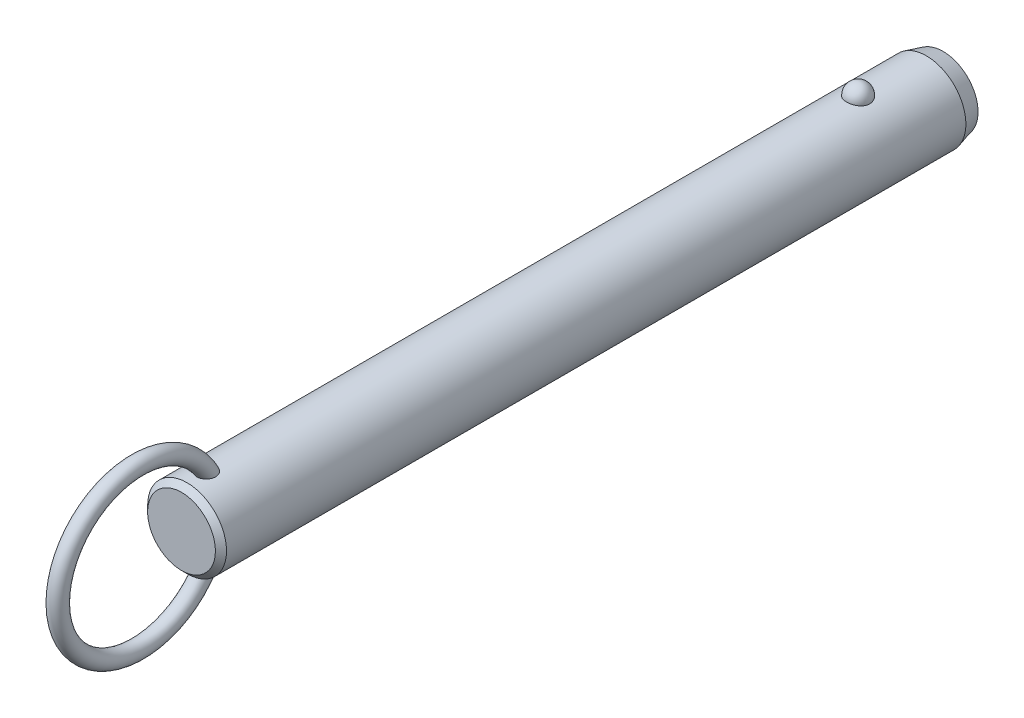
ISO-10303-21;
HEADER;
FILE_DESCRIPTION(('STEP AP214'),'2;1');
FILE_NAME('part.step','',(''),(''),'','','');
FILE_SCHEMA(('AUTOMOTIVE_DESIGN { 1 0 10303 214 1 1 1 1 }'));
ENDSEC;
DATA;
#1=APPLICATION_CONTEXT('core data for automotive mechanical design processes');
#2=APPLICATION_PROTOCOL_DEFINITION('international standard','automotive_design',2000,#1);
#3=PRODUCT_CONTEXT('',#1,'mechanical');
#4=PRODUCT('Part','Part','',(#3));
#5=PRODUCT_RELATED_PRODUCT_CATEGORY('part','',(#4));
#6=PRODUCT_DEFINITION_FORMATION('','',#4);
#7=PRODUCT_DEFINITION_CONTEXT('part definition',#1,'design');
#8=PRODUCT_DEFINITION('design','',#6,#7);
#9=PRODUCT_DEFINITION_SHAPE('','',#8);
#10=(LENGTH_UNIT() NAMED_UNIT(*) SI_UNIT(.MILLI.,.METRE.));
#11=(NAMED_UNIT(*) PLANE_ANGLE_UNIT() SI_UNIT($,.RADIAN.));
#12=(NAMED_UNIT(*) SI_UNIT($,.STERADIAN.) SOLID_ANGLE_UNIT());
#13=UNCERTAINTY_MEASURE_WITH_UNIT(LENGTH_MEASURE(1.E-05),#10,'distance_accuracy_value','');
#14=(GEOMETRIC_REPRESENTATION_CONTEXT(3) GLOBAL_UNCERTAINTY_ASSIGNED_CONTEXT((#13)) GLOBAL_UNIT_ASSIGNED_CONTEXT((#10,
#11,#12)) REPRESENTATION_CONTEXT('',''));
#15=CARTESIAN_POINT('',(0.,0.,0.));
#16=DIRECTION('',(0.,0.,1.));
#17=DIRECTION('',(1.,0.,0.));
#18=AXIS2_PLACEMENT_3D('',#15,#16,#17);
#19=CARTESIAN_POINT('',(0.,0.,111.8));
#20=DIRECTION('',(0.,0.,-1.));
#21=DIRECTION('',(-1.,0.,0.));
#22=AXIS2_PLACEMENT_3D('',#19,#20,#21);
#23=CYLINDRICAL_SURFACE('',#22,7.1);
#24=CARTESIAN_POINT('',(2.0769088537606,6.78943661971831,-2.1));
#25=CARTESIAN_POINT('',(2.07690739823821,6.78943796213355,-1.98268154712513));
#26=CARTESIAN_POINT('',(2.06738130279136,6.79237331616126,-1.86534506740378));
#27=CARTESIAN_POINT('',(2.0295040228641,6.8037853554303,-1.63400788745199));
#28=CARTESIAN_POINT('',(2.00114757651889,6.81226358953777,-1.52000812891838));
#29=CARTESIAN_POINT('',(1.92632025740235,6.83379798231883,-1.29863433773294));
#30=CARTESIAN_POINT('',(1.87985726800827,6.84685214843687,-1.19125744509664));
#31=CARTESIAN_POINT('',(1.76995205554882,6.87608091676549,-0.98604657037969));
#32=CARTESIAN_POINT('',(1.70650980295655,6.8922555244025,-0.88821260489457));
#33=CARTESIAN_POINT('',(1.5638119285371,6.92602930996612,-0.704242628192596));
#34=CARTESIAN_POINT('',(1.4844714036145,6.94363582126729,-0.618173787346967));
#35=CARTESIAN_POINT('',(1.31221746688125,6.97823658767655,-0.460740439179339));
#36=CARTESIAN_POINT('',(1.21930409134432,6.99523084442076,-0.389375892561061));
#37=CARTESIAN_POINT('',(1.02268781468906,7.02666176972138,-0.263547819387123));
#38=CARTESIAN_POINT('',(0.91902009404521,7.04110638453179,-0.209031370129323));
#39=CARTESIAN_POINT('',(0.703548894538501,7.06588726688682,-0.118163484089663));
#40=CARTESIAN_POINT('',(0.591746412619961,7.07622403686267,-0.0818098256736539));
#41=CARTESIAN_POINT('',(0.365557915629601,7.09147068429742,-0.0288711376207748));
#42=CARTESIAN_POINT('',(0.251267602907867,7.09648447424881,-0.0119070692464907));
#43=CARTESIAN_POINT('',(0.0213499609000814,7.10089837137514,0.00304925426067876));
#44=CARTESIAN_POINT('',(-0.0942772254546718,7.10029907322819,0.00104351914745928));
#45=CARTESIAN_POINT('',(-0.321651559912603,7.09360829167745,-0.0216931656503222));
#46=CARTESIAN_POINT('',(-0.433431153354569,7.08760388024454,-0.0421272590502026));
#47=CARTESIAN_POINT('',(-0.651862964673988,7.07086131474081,-0.100729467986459));
#48=CARTESIAN_POINT('',(-0.758515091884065,7.06012307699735,-0.138897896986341));
#49=CARTESIAN_POINT('',(-0.964449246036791,7.03496097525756,-0.232213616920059));
#50=CARTESIAN_POINT('',(-1.06368095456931,7.02051445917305,-0.287465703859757));
#51=CARTESIAN_POINT('',(-1.25145353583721,6.98948740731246,-0.413383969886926));
#52=CARTESIAN_POINT('',(-1.33999321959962,6.97290663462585,-0.48405186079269));
#53=CARTESIAN_POINT('',(-1.50591604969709,6.93898770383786,-0.640594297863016));
#54=CARTESIAN_POINT('',(-1.58302488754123,6.92164094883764,-0.726757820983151));
#55=CARTESIAN_POINT('',(-1.72189320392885,6.8884103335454,-0.91092752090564));
#56=CARTESIAN_POINT('',(-1.78365144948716,6.87252659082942,-1.008934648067));
#57=CARTESIAN_POINT('',(-1.89101272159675,6.84377189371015,-1.21549497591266));
#58=CARTESIAN_POINT('',(-1.93639553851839,6.83094274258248,-1.32416860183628));
#59=CARTESIAN_POINT('',(-2.00874275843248,6.81002070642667,-1.54791500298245));
#60=CARTESIAN_POINT('',(-2.03570774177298,6.80192767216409,-1.66298757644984));
#61=CARTESIAN_POINT('',(-2.07047276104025,6.7914266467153,-1.89571453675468));
#62=CARTESIAN_POINT('',(-2.07835878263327,6.78899315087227,-2.01335491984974));
#63=CARTESIAN_POINT('',(-2.07502083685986,6.79001409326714,-2.24833570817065));
#64=CARTESIAN_POINT('',(-2.06379746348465,6.7934683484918,-2.36567612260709));
#65=CARTESIAN_POINT('',(-2.02263913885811,6.80583442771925,-2.59603194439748));
#66=CARTESIAN_POINT('',(-1.99281127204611,6.81471501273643,-2.70906820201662));
#67=CARTESIAN_POINT('',(-1.91526639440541,6.83691232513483,-2.92836575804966));
#68=CARTESIAN_POINT('',(-1.8675486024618,6.85022924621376,-3.03462676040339));
#69=CARTESIAN_POINT('',(-1.75504492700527,6.87991336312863,-3.23806487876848));
#70=CARTESIAN_POINT('',(-1.69015924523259,6.89629822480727,-3.33518422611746));
#71=CARTESIAN_POINT('',(-1.54505404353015,6.93024852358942,-3.51697105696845));
#72=CARTESIAN_POINT('',(-1.46483385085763,6.94781401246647,-3.60163799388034));
#73=CARTESIAN_POINT('',(-1.29071406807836,6.98225977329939,-3.75654119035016));
#74=CARTESIAN_POINT('',(-1.19675650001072,6.99913673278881,-3.82671308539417));
#75=CARTESIAN_POINT('',(-0.997940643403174,7.03023618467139,-3.9501837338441));
#76=CARTESIAN_POINT('',(-0.89308318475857,7.04445887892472,-4.00348377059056));
#77=CARTESIAN_POINT('',(-0.676902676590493,7.06848365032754,-4.09107242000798));
#78=CARTESIAN_POINT('',(-0.565686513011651,7.0783430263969,-4.12560889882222));
#79=CARTESIAN_POINT('',(-0.338739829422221,7.09282534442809,-4.17575450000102));
#80=CARTESIAN_POINT('',(-0.223009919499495,7.09744899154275,-4.19136617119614));
#81=CARTESIAN_POINT('',(0.00707628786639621,7.10090930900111,-4.20307965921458));
#82=CARTESIAN_POINT('',(0.121410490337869,7.09986531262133,-4.19958377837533));
#83=CARTESIAN_POINT('',(0.347815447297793,7.092380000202,-4.17411564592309));
#84=CARTESIAN_POINT('',(0.459886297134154,7.08593891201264,-4.15214417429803));
#85=CARTESIAN_POINT('',(0.678084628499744,7.06838983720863,-4.09049562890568));
#86=CARTESIAN_POINT('',(0.784237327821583,7.05730369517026,-4.05090137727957));
#87=CARTESIAN_POINT('',(0.988305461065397,7.03163139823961,-3.95511447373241));
#88=CARTESIAN_POINT('',(1.08622031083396,7.01704499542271,-3.89892064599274));
#89=CARTESIAN_POINT('',(1.27284490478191,6.98562668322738,-3.77035541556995));
#90=CARTESIAN_POINT('',(1.36137372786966,6.96876135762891,-3.69772964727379));
#91=CARTESIAN_POINT('',(1.52509486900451,6.93477412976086,-3.53878279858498));
#92=CARTESIAN_POINT('',(1.60028496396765,6.91765218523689,-3.45245943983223));
#93=CARTESIAN_POINT('',(1.73681688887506,6.88465753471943,-3.26658774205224));
#94=CARTESIAN_POINT('',(1.79785966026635,6.86881574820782,-3.16681408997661));
#95=CARTESIAN_POINT('',(1.90265327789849,6.84053157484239,-2.95814408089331));
#96=CARTESIAN_POINT('',(1.94640861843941,6.82808830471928,-2.84925010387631));
#97=CARTESIAN_POINT('',(2.01274378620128,6.80881460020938,-2.63454318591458));
#98=CARTESIAN_POINT('',(2.03676193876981,6.80160856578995,-2.52920574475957));
#99=CARTESIAN_POINT('',(2.06884490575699,6.79191902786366,-2.3159172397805));
#100=CARTESIAN_POINT('',(2.07691019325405,6.78943538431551,-2.20796625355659));
#101=CARTESIAN_POINT('',(2.0769088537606,6.78943661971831,-2.1));
#102=B_SPLINE_CURVE_WITH_KNOTS('',3,(#24,#25,#26,#27,#28,#29,#30,#31,#32,#33,#34,#35,#36,#37,
#38,#39,#40,#41,#42,#43,#44,#45,#46,#47,#48,#49,#50,#51,#52,#53,#54,#55,#56,#57,#58,#59,#60,#61,
#62,#63,#64,#65,#66,#67,#68,#69,#70,#71,#72,#73,#74,#75,#76,#77,#78,#79,#80,#81,#82,#83,#84,#85,
#86,#87,#88,#89,#90,#91,#92,#93,#94,#95,#96,#97,#98,#99,#100,#101),.UNSPECIFIED.,.T.,.F.,(4,2,2,
2,2,2,2,2,2,2,2,2,2,2,2,2,2,2,2,2,2,2,2,2,2,2,2,2,2,2,2,2,2,2,2,2,2,2,4),(0.,0.351568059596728,
0.703234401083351,1.05474780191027,1.40626181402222,1.75970563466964,2.11314851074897,
2.4654696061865,2.81774759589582,3.16301449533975,3.50824481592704,3.84801136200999,
4.18778391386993,4.52968352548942,4.87162112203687,5.22076181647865,5.56993054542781,
5.92363364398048,6.27732559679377,6.62942052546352,6.98150450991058,7.33158042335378,
7.68167162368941,8.03384443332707,8.38603269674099,8.73975272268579,9.09344583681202,
9.44234545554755,9.79119807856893,10.1327344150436,10.4742563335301,10.8141898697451,
11.1541474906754,11.4997793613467,11.8454687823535,12.1979079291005,12.5502553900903,
12.8738073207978,13.1973496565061),.UNSPECIFIED.);
#103=CARTESIAN_POINT('',(2.0769088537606,6.78943661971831,-2.1));
#104=VERTEX_POINT('',#103);
#105=EDGE_CURVE('E41',#104,#104,#102,.T.);
#106=ORIENTED_EDGE('',*,*,#105,.T.);
#107=EDGE_LOOP('',(#106));
#108=FACE_BOUND('',#107,.T.);
#109=CARTESIAN_POINT('',(0.,0.,118.72));
#110=DIRECTION('',(0.,0.,1.));
#111=DIRECTION('',(1.,0.,0.));
#112=AXIS2_PLACEMENT_3D('',#109,#110,#111);
#113=CIRCLE('',#112,7.1);
#114=CARTESIAN_POINT('',(7.1,0.,118.72));
#115=VERTEX_POINT('',#114);
#116=EDGE_CURVE('E10',#115,#115,#113,.F.);
#117=ORIENTED_EDGE('',*,*,#116,.T.);
#118=EDGE_LOOP('',(#117));
#119=FACE_BOUND('',#118,.T.);
#120=CARTESIAN_POINT('',(-0.429539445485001,-7.08699541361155,113.542921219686));
#121=CARTESIAN_POINT('',(-0.508331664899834,-7.08221999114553,113.566876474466));
#122=CARTESIAN_POINT('',(-0.585039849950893,-7.07624016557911,113.597457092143));
#123=CARTESIAN_POINT('',(-0.732082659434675,-7.06254296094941,113.671024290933));
#124=CARTESIAN_POINT('',(-0.802417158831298,-7.05482554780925,113.714011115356));
#125=CARTESIAN_POINT('',(-0.934722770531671,-7.03851844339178,113.811113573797));
#126=CARTESIAN_POINT('',(-0.996700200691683,-7.02992941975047,113.865220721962));
#127=CARTESIAN_POINT('',(-1.11079942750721,-7.01280697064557,113.982967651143));
#128=CARTESIAN_POINT('',(-1.16292136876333,-7.00427354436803,114.046607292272));
#129=CARTESIAN_POINT('',(-1.25705660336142,-6.98799959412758,114.182687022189));
#130=CARTESIAN_POINT('',(-1.2988803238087,-6.98027525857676,114.255259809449));
#131=CARTESIAN_POINT('',(-1.37069920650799,-6.96652886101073,114.406168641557));
#132=CARTESIAN_POINT('',(-1.40069157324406,-6.96050720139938,114.484506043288));
#133=CARTESIAN_POINT('',(-1.45043507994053,-6.95031881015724,114.650190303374));
#134=CARTESIAN_POINT('',(-1.46937115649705,-6.94630231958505,114.737789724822));
#135=CARTESIAN_POINT('',(-1.49424917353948,-6.94099239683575,114.914871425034));
#136=CARTESIAN_POINT('',(-1.50018601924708,-6.93970003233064,115.004354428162));
#137=CARTESIAN_POINT('',(-1.49978214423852,-6.93978815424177,115.194060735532));
#138=CARTESIAN_POINT('',(-1.49187639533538,-6.94150934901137,115.294279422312));
#139=CARTESIAN_POINT('',(-1.46177925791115,-6.94790814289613,115.492479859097));
#140=CARTESIAN_POINT('',(-1.43957541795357,-6.95258831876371,115.590459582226));
#141=CARTESIAN_POINT('',(-1.37783293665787,-6.96510647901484,115.79536292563));
#142=CARTESIAN_POINT('',(-1.33634073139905,-6.97328848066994,115.901680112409));
#143=CARTESIAN_POINT('',(-1.23686994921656,-6.99161706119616,116.106177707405));
#144=CARTESIAN_POINT('',(-1.17889192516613,-7.00176357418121,116.204358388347));
#145=CARTESIAN_POINT('',(-1.05875124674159,-7.02082898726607,116.372374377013));
#146=CARTESIAN_POINT('',(-0.999247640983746,-7.02963746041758,116.444123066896));
#147=CARTESIAN_POINT('',(-0.869494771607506,-7.04686074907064,116.577195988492));
#148=CARTESIAN_POINT('',(-0.799263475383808,-7.05527619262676,116.638537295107));
#149=CARTESIAN_POINT('',(-0.665408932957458,-7.06899457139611,116.735131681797));
#150=CARTESIAN_POINT('',(-0.603817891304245,-7.07457275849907,116.773151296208));
#151=CARTESIAN_POINT('',(-0.47517283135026,-7.08437420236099,116.838758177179));
#152=CARTESIAN_POINT('',(-0.408123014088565,-7.08859848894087,116.866353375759));
#153=CARTESIAN_POINT('',(-0.269431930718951,-7.09522749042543,116.909256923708));
#154=CARTESIAN_POINT('',(-0.19775731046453,-7.09761688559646,116.924461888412));
#155=CARTESIAN_POINT('',(-0.0527849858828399,-7.10017268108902,116.940716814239));
#156=CARTESIAN_POINT('',(0.0205115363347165,-7.10034065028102,116.941776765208));
#157=CARTESIAN_POINT('',(0.156426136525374,-7.09855986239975,116.930461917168));
#158=CARTESIAN_POINT('',(0.219199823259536,-7.09688191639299,116.919806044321));
#159=CARTESIAN_POINT('',(0.342134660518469,-7.09201880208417,116.888537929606));
#160=CARTESIAN_POINT('',(0.402295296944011,-7.08883333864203,116.867923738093));
#161=CARTESIAN_POINT('',(0.520687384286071,-7.08113868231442,116.817212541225));
#162=CARTESIAN_POINT('',(0.57879126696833,-7.07658958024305,116.786827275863));
#163=CARTESIAN_POINT('',(0.690173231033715,-7.06659708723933,116.718367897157));
#164=CARTESIAN_POINT('',(0.74344785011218,-7.061153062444,116.680288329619));
#165=CARTESIAN_POINT('',(0.870947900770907,-7.04680292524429,116.576592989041));
#166=CARTESIAN_POINT('',(0.941828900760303,-7.0375580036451,116.506897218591));
#167=CARTESIAN_POINT('',(1.07136606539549,-7.01900793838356,116.356945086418));
#168=CARTESIAN_POINT('',(1.13000013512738,-7.00970271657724,116.276670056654));
#169=CARTESIAN_POINT('',(1.23579584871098,-6.99183327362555,116.106899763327));
#170=CARTESIAN_POINT('',(1.28274271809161,-6.98328455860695,116.017269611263));
#171=CARTESIAN_POINT('',(1.36351442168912,-6.96796352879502,115.832176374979));
#172=CARTESIAN_POINT('',(1.39733971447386,-6.96119115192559,115.736713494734));
#173=CARTESIAN_POINT('',(1.45579181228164,-6.94922464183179,115.52530928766));
#174=CARTESIAN_POINT('',(1.47790145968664,-6.94449000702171,115.408631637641));
#175=CARTESIAN_POINT('',(1.50168752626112,-6.93938731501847,115.173015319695));
#176=CARTESIAN_POINT('',(1.50336085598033,-6.93901991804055,115.05407631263));
#177=CARTESIAN_POINT('',(1.48486516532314,-6.9430010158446,114.82360799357));
#178=CARTESIAN_POINT('',(1.46573441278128,-6.9471253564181,114.711995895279));
#179=CARTESIAN_POINT('',(1.40606892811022,-6.95944667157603,114.494886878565));
#180=CARTESIAN_POINT('',(1.36556446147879,-6.96763788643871,114.3893815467));
#181=CARTESIAN_POINT('',(1.27082700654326,-6.98548038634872,114.204287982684));
#182=CARTESIAN_POINT('',(1.21949810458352,-6.99473841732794,114.123171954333));
#183=CARTESIAN_POINT('',(1.10242050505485,-7.01414069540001,113.972227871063));
#184=CARTESIAN_POINT('',(1.0366811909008,-7.02428436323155,113.90239252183));
#185=CARTESIAN_POINT('',(0.900559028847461,-7.04295285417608,113.783573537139));
#186=CARTESIAN_POINT('',(0.831428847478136,-7.05153466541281,113.733157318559));
#187=CARTESIAN_POINT('',(0.685291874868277,-7.06723150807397,113.645142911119));
#188=CARTESIAN_POINT('',(0.608287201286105,-7.0743469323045,113.607541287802));
#189=CARTESIAN_POINT('',(0.451878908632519,-7.08602232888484,113.547491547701));
#190=CARTESIAN_POINT('',(0.372686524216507,-7.09067127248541,113.524508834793));
#191=CARTESIAN_POINT('',(0.211477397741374,-7.09730788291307,113.492035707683));
#192=CARTESIAN_POINT('',(0.12946098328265,-7.09929585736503,113.48254373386));
#193=CARTESIAN_POINT('',(-0.0332905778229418,-7.10037858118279,113.477351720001));
#194=CARTESIAN_POINT('',(-0.114016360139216,-7.09953334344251,113.481365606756));
#195=CARTESIAN_POINT('',(-0.273670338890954,-7.09517338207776,113.502454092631));
#196=CARTESIAN_POINT('',(-0.352598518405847,-7.09165863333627,113.519528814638));
#197=CARTESIAN_POINT('',(-0.429539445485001,-7.08699541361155,113.542921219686));
#198=B_SPLINE_CURVE_WITH_KNOTS('',3,(#120,#121,#122,#123,#124,#125,#126,#127,#128,#129,#130,
#131,#132,#133,#134,#135,#136,#137,#138,#139,#140,#141,#142,#143,#144,#145,#146,#147,#148,#149,
#150,#151,#152,#153,#154,#155,#156,#157,#158,#159,#160,#161,#162,#163,#164,#165,#166,#167,#168,
#169,#170,#171,#172,#173,#174,#175,#176,#177,#178,#179,#180,#181,#182,#183,#184,#185,#186,#187,
#188,#189,#190,#191,#192,#193,#194,#195,#196,#197),.UNSPECIFIED.,.T.,.F.,(4,2,2,2,2,2,2,2,2,2,2,
2,2,2,2,2,2,2,2,2,2,2,2,2,2,2,2,2,2,2,2,2,2,2,2,2,2,2,4),(0.,0.247183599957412,
0.494372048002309,0.741372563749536,0.988369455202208,1.23962059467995,1.49093106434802,
1.75897818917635,2.02713035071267,2.32758265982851,2.62829697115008,2.97008736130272,
3.31186629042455,3.59175319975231,3.87117637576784,4.08813841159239,4.30493502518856,
4.52352259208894,4.7419557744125,4.93215328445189,5.12238804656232,5.31884850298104,
5.51544871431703,5.81332317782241,6.11173048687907,6.41527266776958,6.71880423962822,
7.073581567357,7.42841252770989,7.76631485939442,8.10373999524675,8.39142246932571,
8.67891817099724,8.93560332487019,9.19221962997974,9.43881106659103,9.68537399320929,
9.92674752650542,10.1681233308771),.UNSPECIFIED.);
#199=CARTESIAN_POINT('',(-0.429539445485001,-7.08699541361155,113.542921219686));
#200=VERTEX_POINT('',#199);
#201=EDGE_CURVE('E59',#200,#200,#198,.T.);
#202=ORIENTED_EDGE('',*,*,#201,.T.);
#203=EDGE_LOOP('',(#202));
#204=FACE_BOUND('',#203,.T.);
#205=CARTESIAN_POINT('',(-0.429539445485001,7.08699541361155,113.542921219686));
#206=CARTESIAN_POINT('',(-0.351665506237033,7.09171429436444,113.519246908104));
#207=CARTESIAN_POINT('',(-0.271733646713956,7.09525896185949,113.502036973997));
#208=CARTESIAN_POINT('',(-0.11002645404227,7.09960839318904,113.481005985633));
#209=CARTESIAN_POINT('',(-0.0282502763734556,7.10041187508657,113.477191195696));
#210=CARTESIAN_POINT('',(0.134782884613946,7.09918849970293,113.483059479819));
#211=CARTESIAN_POINT('',(0.21603995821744,7.09716214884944,113.49274013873));
#212=CARTESIAN_POINT('',(0.375730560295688,7.09050177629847,113.525347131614));
#213=CARTESIAN_POINT('',(0.454164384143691,7.08586802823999,113.548272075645));
#214=CARTESIAN_POINT('',(0.606025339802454,7.07449911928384,113.606771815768));
#215=CARTESIAN_POINT('',(0.679451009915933,7.06776334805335,113.642350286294));
#216=CARTESIAN_POINT('',(0.81923414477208,7.05292866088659,113.725175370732));
#217=CARTESIAN_POINT('',(0.885591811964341,7.04482978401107,113.772421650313));
#218=CARTESIAN_POINT('',(1.00993211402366,7.02808709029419,113.877590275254));
#219=CARTESIAN_POINT('',(1.06785399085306,7.01943990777,113.935583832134));
#220=CARTESIAN_POINT('',(1.17342527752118,7.00256662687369,114.060301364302));
#221=CARTESIAN_POINT('',(1.22107408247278,6.99434055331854,114.127025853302));
#222=CARTESIAN_POINT('',(1.30652927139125,6.97889183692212,114.269362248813));
#223=CARTESIAN_POINT('',(1.34399711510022,6.97170674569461,114.345180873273));
#224=CARTESIAN_POINT('',(1.40682616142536,6.95930080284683,114.501810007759));
#225=CARTESIAN_POINT('',(1.43218374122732,6.95408053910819,114.58262200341));
#226=CARTESIAN_POINT('',(1.47246409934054,6.94566853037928,114.753531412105));
#227=CARTESIAN_POINT('',(1.48642590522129,6.9426653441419,114.84386307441));
#228=CARTESIAN_POINT('',(1.5011410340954,6.93949744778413,115.025619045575));
#229=CARTESIAN_POINT('',(1.50188917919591,6.93933385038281,115.117043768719));
#230=CARTESIAN_POINT('',(1.49030464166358,6.94183245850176,115.31084381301));
#231=CARTESIAN_POINT('',(1.47627413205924,6.94486147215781,115.413112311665));
#232=CARTESIAN_POINT('',(1.43356351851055,6.95380194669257,115.614471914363));
#233=CARTESIAN_POINT('',(1.40486768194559,6.95971650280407,115.713559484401));
#234=CARTESIAN_POINT('',(1.32908750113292,6.97461208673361,115.918908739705));
#235=CARTESIAN_POINT('',(1.28011435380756,6.98388945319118,116.024456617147));
#236=CARTESIAN_POINT('',(1.16520357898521,7.00397743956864,116.225760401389));
#237=CARTESIAN_POINT('',(1.09927694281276,7.01478706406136,116.321522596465));
#238=CARTESIAN_POINT('',(0.969361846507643,7.03373936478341,116.476756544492));
#239=CARTESIAN_POINT('',(0.909042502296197,7.04187023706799,116.539303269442));
#240=CARTESIAN_POINT('',(0.779178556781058,7.05741732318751,116.654053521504));
#241=CARTESIAN_POINT('',(0.709649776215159,7.06483472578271,116.706274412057));
#242=CARTESIAN_POINT('',(0.576854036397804,7.0767751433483,116.788113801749));
#243=CARTESIAN_POINT('',(0.515118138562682,7.08158033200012,116.820164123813));
#244=CARTESIAN_POINT('',(0.387127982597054,7.08972701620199,116.873765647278));
#245=CARTESIAN_POINT('',(0.320877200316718,7.09306962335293,116.895324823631));
#246=CARTESIAN_POINT('',(0.18504126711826,7.09791507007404,116.926400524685));
#247=CARTESIAN_POINT('',(0.115437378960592,7.09940591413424,116.935838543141));
#248=CARTESIAN_POINT('',(-0.024315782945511,7.10030171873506,116.941522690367));
#249=CARTESIAN_POINT('',(-0.0944648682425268,7.0997073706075,116.937773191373));
#250=CARTESIAN_POINT('',(-0.225713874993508,7.09668414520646,116.918508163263));
#251=CARTESIAN_POINT('',(-0.287006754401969,7.09444865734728,116.904232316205));
#252=CARTESIAN_POINT('',(-0.406555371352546,7.08860360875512,116.866368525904));
#253=CARTESIAN_POINT('',(-0.464809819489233,7.08499346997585,116.842776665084));
#254=CARTESIAN_POINT('',(-0.594955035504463,7.07541654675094,116.778923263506));
#255=CARTESIAN_POINT('',(-0.665389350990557,7.06906574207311,116.735753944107));
#256=CARTESIAN_POINT('',(-0.798242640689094,7.05530261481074,116.638587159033));
#257=CARTESIAN_POINT('',(-0.860645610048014,7.0478882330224,116.584568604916));
#258=CARTESIAN_POINT('',(-0.99424943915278,7.03045217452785,116.450996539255));
#259=CARTESIAN_POINT('',(-1.06260129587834,7.02030745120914,116.368614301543));
#260=CARTESIAN_POINT('',(-1.18502045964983,7.00068382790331,116.193843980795));
#261=CARTESIAN_POINT('',(-1.239076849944,6.99120544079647,116.101448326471));
#262=CARTESIAN_POINT('',(-1.33335589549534,6.97384343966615,115.908008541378));
#263=CARTESIAN_POINT('',(-1.3733613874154,6.96598557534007,115.806856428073));
#264=CARTESIAN_POINT('',(-1.43770677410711,6.9529905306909,115.599504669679));
#265=CARTESIAN_POINT('',(-1.46204473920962,6.94785368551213,115.49330440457));
#266=CARTESIAN_POINT('',(-1.49537533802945,6.94076296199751,115.268231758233));
#267=CARTESIAN_POINT('',(-1.50273564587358,6.93914842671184,115.14909751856));
#268=CARTESIAN_POINT('',(-1.4954555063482,6.94072368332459,114.911470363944));
#269=CARTESIAN_POINT('',(-1.48082914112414,6.94391040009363,114.792977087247));
#270=CARTESIAN_POINT('',(-1.43076401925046,6.95438579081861,114.573432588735));
#271=CARTESIAN_POINT('',(-1.39762227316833,6.96121852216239,114.471841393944));
#272=CARTESIAN_POINT('',(-1.31211274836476,6.97783941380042,114.277351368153));
#273=CARTESIAN_POINT('',(-1.2597660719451,6.98762432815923,114.18444313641));
#274=CARTESIAN_POINT('',(-1.14583073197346,7.00713153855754,114.024160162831));
#275=CARTESIAN_POINT('',(-1.0866594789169,7.01665982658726,113.955035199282));
#276=CARTESIAN_POINT('',(-0.956606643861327,7.03556646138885,113.828878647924));
#277=CARTESIAN_POINT('',(-0.885737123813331,7.04494495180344,113.771834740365));
#278=CARTESIAN_POINT('',(-0.751558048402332,7.06035735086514,113.683100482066));
#279=CARTESIAN_POINT('',(-0.690120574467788,7.0666695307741,113.648593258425));
#280=CARTESIAN_POINT('',(-0.562815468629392,7.07794609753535,113.588750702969));
#281=CARTESIAN_POINT('',(-0.496948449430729,7.08291067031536,113.563414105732));
#282=CARTESIAN_POINT('',(-0.429539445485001,7.08699541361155,113.542921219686));
#283=B_SPLINE_CURVE_WITH_KNOTS('',3,(#205,#206,#207,#208,#209,#210,#211,#212,#213,#214,#215,
#216,#217,#218,#219,#220,#221,#222,#223,#224,#225,#226,#227,#228,#229,#230,#231,#232,#233,#234,
#235,#236,#237,#238,#239,#240,#241,#242,#243,#244,#245,#246,#247,#248,#249,#250,#251,#252,#253,
#254,#255,#256,#257,#258,#259,#260,#261,#262,#263,#264,#265,#266,#267,#268,#269,#270,#271,#272,
#273,#274,#275,#276,#277,#278,#279,#280,#281,#282),.UNSPECIFIED.,.T.,.F.,(4,2,2,2,2,2,2,2,2,2,2,
2,2,2,2,2,2,2,2,2,2,2,2,2,2,2,2,2,2,2,2,2,2,2,2,2,2,2,4),(0.,0.244335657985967,
0.488785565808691,0.73319173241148,0.977572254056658,1.22202379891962,1.46646834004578,
1.71259457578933,1.95873529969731,2.21226768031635,2.46587585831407,2.73913816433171,
3.01250754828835,3.3210993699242,3.63002293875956,3.9786351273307,4.32702187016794,
4.58793945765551,4.84841449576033,5.05676704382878,5.26496096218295,5.47449661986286,
5.68396281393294,5.87205447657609,6.06022532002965,6.30743751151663,6.55513496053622,
6.87602468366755,7.19715875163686,7.52305774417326,7.84899686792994,8.20516155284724,
8.56109821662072,8.88040084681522,9.19935367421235,9.4723628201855,9.74509220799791,
9.95662250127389,10.1681235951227),.UNSPECIFIED.);
#284=CARTESIAN_POINT('',(-0.429539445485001,7.08699541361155,113.542921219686));
#285=VERTEX_POINT('',#284);
#286=EDGE_CURVE('E67',#285,#285,#283,.T.);
#287=ORIENTED_EDGE('',*,*,#286,.T.);
#288=EDGE_LOOP('',(#287));
#289=FACE_BOUND('',#288,.T.);
#290=CARTESIAN_POINT('',(0.,0.,-14.3999999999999));
#291=DIRECTION('',(0.,0.,-1.));
#292=DIRECTION('',(-1.,0.,0.));
#293=AXIS2_PLACEMENT_3D('',#290,#291,#292);
#294=CIRCLE('',#293,7.1);
#295=CARTESIAN_POINT('',(-7.1,0.,-14.3999999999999));
#296=VERTEX_POINT('',#295);
#297=EDGE_CURVE('E56',#296,#296,#294,.F.);
#298=ORIENTED_EDGE('',*,*,#297,.T.);
#299=EDGE_LOOP('',(#298));
#300=FACE_BOUND('',#299,.T.);
#301=ADVANCED_FACE('F37',(#108,#119,#204,#289,#300),#23,.T.);
#302=CARTESIAN_POINT('',(0.,0.,-17.4));
#303=DIRECTION('',(0.,0.,-1.));
#304=DIRECTION('',(-1.,0.,0.));
#305=AXIS2_PLACEMENT_3D('',#302,#303,#304);
#306=PLANE('',#305);
#307=CARTESIAN_POINT('',(0.,0.,-17.4));
#308=DIRECTION('',(0.,0.,-1.));
#309=DIRECTION('',(-1.,0.,0.));
#310=AXIS2_PLACEMENT_3D('',#307,#308,#309);
#311=CIRCLE('',#310,6.29615242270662);
#312=CARTESIAN_POINT('',(-6.29615242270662,0.,-17.4));
#313=VERTEX_POINT('',#312);
#314=EDGE_CURVE('E66',#313,#313,#311,.T.);
#315=ORIENTED_EDGE('',*,*,#314,.T.);
#316=EDGE_LOOP('',(#315));
#317=FACE_BOUND('',#316,.T.);
#318=ADVANCED_FACE('F85',(#317),#306,.T.);
#319=CARTESIAN_POINT('',(0.,0.,-17.4));
#320=DIRECTION('',(0.,0.,1.));
#321=DIRECTION('',(1.,0.,0.));
#322=AXIS2_PLACEMENT_3D('',#319,#320,#321);
#323=CONICAL_SURFACE('',#322,6.29615242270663,0.261799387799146);
#324=ORIENTED_EDGE('',*,*,#297,.F.);
#325=EDGE_LOOP('',(#324));
#326=FACE_BOUND('',#325,.T.);
#327=ORIENTED_EDGE('',*,*,#314,.F.);
#328=EDGE_LOOP('',(#327));
#329=FACE_BOUND('',#328,.T.);
#330=ADVANCED_FACE('F83',(#326,#329),#323,.T.);
#331=CARTESIAN_POINT('',(0.,0.,119.72));
#332=DIRECTION('',(0.,0.,1.));
#333=DIRECTION('',(1.,0.,0.));
#334=AXIS2_PLACEMENT_3D('',#331,#332,#333);
#335=PLANE('',#334);
#336=CARTESIAN_POINT('',(0.,0.,119.72));
#337=DIRECTION('',(0.,0.,1.));
#338=DIRECTION('',(1.,0.,0.));
#339=AXIS2_PLACEMENT_3D('',#336,#337,#338);
#340=CIRCLE('',#339,6.09999999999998);
#341=CARTESIAN_POINT('',(6.09999999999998,0.,119.72));
#342=VERTEX_POINT('',#341);
#343=EDGE_CURVE('E50',#342,#342,#340,.T.);
#344=ORIENTED_EDGE('',*,*,#343,.T.);
#345=EDGE_LOOP('',(#344));
#346=FACE_BOUND('',#345,.T.);
#347=ADVANCED_FACE('F77',(#346),#335,.T.);
#348=CARTESIAN_POINT('',(0.,0.,127.65));
#349=DIRECTION('',(1.,0.,0.));
#350=DIRECTION('',(0.,0.,-1.));
#351=AXIS2_PLACEMENT_3D('',#348,#349,#350);
#352=TOROIDAL_SURFACE('',#351,14.35,1.5);
#353=ORIENTED_EDGE('',*,*,#286,.F.);
#354=EDGE_LOOP('',(#353));
#355=FACE_BOUND('',#354,.T.);
#356=ORIENTED_EDGE('',*,*,#201,.F.);
#357=EDGE_LOOP('',(#356));
#358=FACE_BOUND('',#357,.T.);
#359=ADVANCED_FACE('F73',(#355,#358),#352,.T.);
#360=CARTESIAN_POINT('',(0.,0.,119.72));
#361=DIRECTION('',(0.,0.,-1.));
#362=DIRECTION('',(-1.,0.,0.));
#363=AXIS2_PLACEMENT_3D('',#360,#361,#362);
#364=CONICAL_SURFACE('',#363,6.09999999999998,0.785398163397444);
#365=ORIENTED_EDGE('',*,*,#116,.F.);
#366=EDGE_LOOP('',(#365));
#367=FACE_BOUND('',#366,.T.);
#368=ORIENTED_EDGE('',*,*,#343,.F.);
#369=EDGE_LOOP('',(#368));
#370=FACE_BOUND('',#369,.T.);
#371=ADVANCED_FACE('F39',(#367,#370),#364,.T.);
#372=CARTESIAN_POINT('',(0.,7.1,-2.1));
#373=DIRECTION('',(0.,1.,0.));
#374=DIRECTION('',(0.,0.,1.));
#375=AXIS2_PLACEMENT_3D('',#372,#373,#374);
#376=SPHERICAL_SURFACE('',#375,2.10000000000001);
#377=ORIENTED_EDGE('',*,*,#105,.F.);
#378=EDGE_LOOP('',(#377));
#379=FACE_BOUND('',#378,.T.);
#380=ADVANCED_FACE('F79',(#379),#376,.T.);
#381=CLOSED_SHELL('',(#301,#318,#330,#347,#359,#371,#380));
#382=MANIFOLD_SOLID_BREP('B2',#381);
#383=ADVANCED_BREP_SHAPE_REPRESENTATION('',(#18,#382),#14);
#384=SHAPE_DEFINITION_REPRESENTATION(#9,#383);
ENDSEC;
END-ISO-10303-21;
